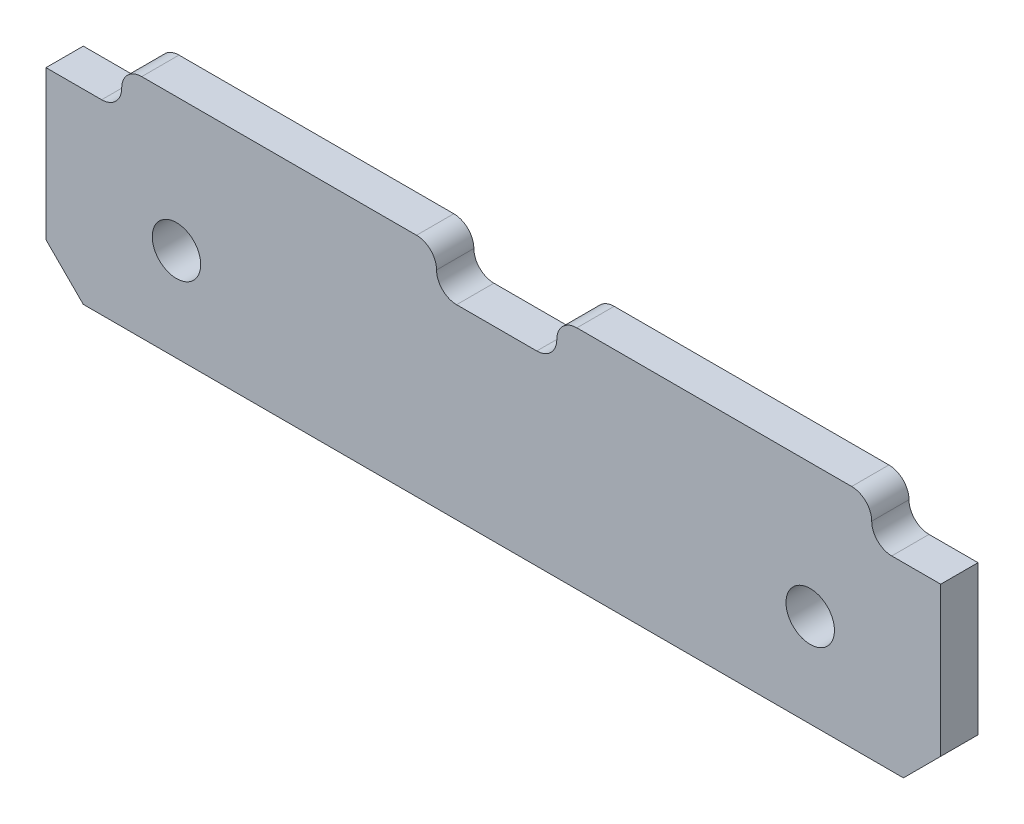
from build123d import *

# Parameters (mm, degrees)
ESQUISSE1_W             = 240
ESQUISSE1_H             = 50
BOSS_EXTRU_1_DEPTH      = 10
BOSS_EXTRU_2_DEPTH      = 10
ESQUISSE3_R             = 6.5
ENL_V_MAT_EXTRU_1_DEPTH = 246.356882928
CHANFREIN1_SIZE         = 10


with BuildPart() as part:
    # Esquisse1 → Boss.-Extru.1 (new body)
    with BuildSketch(Plane.XY):
        with Locations((120, -25)):
            Rectangle(ESQUISSE1_W, ESQUISSE1_H)
    extrude(amount=BOSS_EXTRU_1_DEPTH)

    # Esquisse2 → Boss.-Extru.2 (add)
    with BuildSketch(Plane(origin=(0, 0, 0), x_dir=(-1, 0, 0), z_dir=(0, 0, -1))):
        with BuildLine():
            Line((-216.110279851, 10.752688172), (-142.399577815, 10.752688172))
            ThreePointArc((-142.399577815, 10.752688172), (-138.597928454, 9.177993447), (-137.023233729, 5.376344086))
            ThreePointArc((-137.023233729, 5.376344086), (-135.448539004, 1.574694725), (-131.646889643, 0))
            Line((-131.646889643, 0), (-226.862968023, 0))
            ThreePointArc((-226.862968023, 0), (-223.061318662, 1.574694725), (-221.486623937, 5.376344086))
            ThreePointArc((-221.486623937, 5.376344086), (-219.911929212, 9.177993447), (-216.110279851, 10.752688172))
        make_face()
        with BuildLine():
            Line((-99.388825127, 10.752688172), (-25.678123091, 10.752688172))
            ThreePointArc((-25.678123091, 10.752688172), (-21.876473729, 9.177993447), (-20.301779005, 5.376344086))
            ThreePointArc((-20.301779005, 5.376344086), (-18.72708428, 1.574694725), (-14.925434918, 0))
            Line((-14.925434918, 0), (-110.141513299, 0))
            ThreePointArc((-110.141513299, 0), (-106.339863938, 1.574694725), (-104.765169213, 5.376344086))
            ThreePointArc((-104.765169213, 5.376344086), (-103.190474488, 9.177993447), (-99.388825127, 10.752688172))
        make_face()
    extrude(amount=-BOSS_EXTRU_2_DEPTH)

    # Esquisse3 → Enl_v. mat.-Extru.1 (cut, through all)
    with BuildSketch(Plane(origin=(0, 0, 0), x_dir=(-1, 0, 0), z_dir=(0, 0, -1))):
        with Locations((-205, -25)):
            Circle(ESQUISSE3_R)
        with Locations((-35, -25)):
            Circle(ESQUISSE3_R)
    extrude(amount=-ENL_V_MAT_EXTRU_1_DEPTH, mode=Mode.SUBTRACT)

    # Chanfrein1
    chanfrein1_edges = [part.edges().sort_by_distance(p)[0] for p in [
        (240, -50, 5),
        (0, -50, 5),
    ]]
    chamfer(chanfrein1_edges, length=CHANFREIN1_SIZE)


solid = part.part
